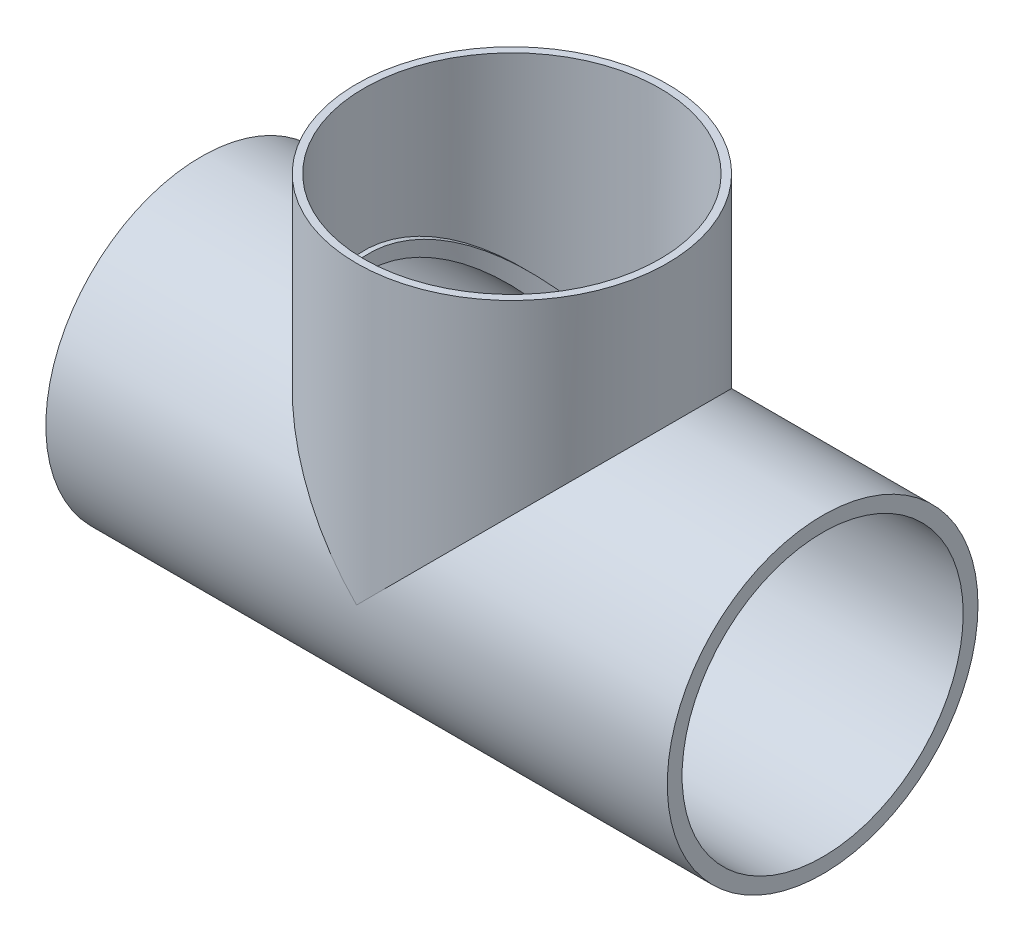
ISO-10303-21;
HEADER;
FILE_DESCRIPTION(('STEP AP214'),'2;1');
FILE_NAME('part.step','',(''),(''),'','','');
FILE_SCHEMA(('AUTOMOTIVE_DESIGN { 1 0 10303 214 1 1 1 1 }'));
ENDSEC;
DATA;
#1=APPLICATION_CONTEXT('core data for automotive mechanical design processes');
#2=APPLICATION_PROTOCOL_DEFINITION('international standard','automotive_design',2000,#1);
#3=PRODUCT_CONTEXT('',#1,'mechanical');
#4=PRODUCT('Part','Part','',(#3));
#5=PRODUCT_RELATED_PRODUCT_CATEGORY('part','',(#4));
#6=PRODUCT_DEFINITION_FORMATION('','',#4);
#7=PRODUCT_DEFINITION_CONTEXT('part definition',#1,'design');
#8=PRODUCT_DEFINITION('design','',#6,#7);
#9=PRODUCT_DEFINITION_SHAPE('','',#8);
#10=(LENGTH_UNIT() NAMED_UNIT(*) SI_UNIT(.MILLI.,.METRE.));
#11=(NAMED_UNIT(*) PLANE_ANGLE_UNIT() SI_UNIT($,.RADIAN.));
#12=(NAMED_UNIT(*) SI_UNIT($,.STERADIAN.) SOLID_ANGLE_UNIT());
#13=UNCERTAINTY_MEASURE_WITH_UNIT(LENGTH_MEASURE(1.E-05),#10,'distance_accuracy_value','');
#14=(GEOMETRIC_REPRESENTATION_CONTEXT(3) GLOBAL_UNCERTAINTY_ASSIGNED_CONTEXT((#13)) GLOBAL_UNIT_ASSIGNED_CONTEXT((#10,
#11,#12)) REPRESENTATION_CONTEXT('',''));
#15=CARTESIAN_POINT('',(0.,0.,0.));
#16=DIRECTION('',(0.,0.,1.));
#17=DIRECTION('',(1.,0.,0.));
#18=AXIS2_PLACEMENT_3D('',#15,#16,#17);
#19=CARTESIAN_POINT('',(126.,0.,0.));
#20=DIRECTION('',(-1.,0.,0.));
#21=DIRECTION('',(0.,0.,1.));
#22=AXIS2_PLACEMENT_3D('',#19,#20,#21);
#23=CYLINDRICAL_SURFACE('',#22,28.5);
#24=CARTESIAN_POINT('',(126.,0.,0.));
#25=DIRECTION('',(1.,0.,0.));
#26=DIRECTION('',(0.,0.,-1.));
#27=AXIS2_PLACEMENT_3D('',#24,#25,#26);
#28=CIRCLE('',#27,28.5);
#29=CARTESIAN_POINT('',(126.,0.,-28.5));
#30=VERTEX_POINT('',#29);
#31=EDGE_CURVE('E175',#30,#30,#28,.T.);
#32=ORIENTED_EDGE('',*,*,#31,.T.);
#33=EDGE_LOOP('',(#32));
#34=FACE_BOUND('',#33,.T.);
#35=CARTESIAN_POINT('',(0.,0.,0.));
#36=DIRECTION('',(1.,0.,0.));
#37=DIRECTION('',(0.,0.,-1.));
#38=AXIS2_PLACEMENT_3D('',#35,#36,#37);
#39=CIRCLE('',#38,28.5);
#40=CARTESIAN_POINT('',(0.,0.,-28.5));
#41=VERTEX_POINT('',#40);
#42=EDGE_CURVE('E170',#41,#41,#39,.T.);
#43=ORIENTED_EDGE('',*,*,#42,.F.);
#44=EDGE_LOOP('',(#43));
#45=FACE_BOUND('',#44,.T.);
#46=CARTESIAN_POINT('',(81.781639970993,18.,22.0963797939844));
#47=CARTESIAN_POINT('',(82.0534936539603,18.2836542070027,21.8653014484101));
#48=CARTESIAN_POINT('',(82.3229213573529,18.5642402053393,21.6276551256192));
#49=CARTESIAN_POINT('',(82.8563806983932,19.1188821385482,21.1389473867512));
#50=CARTESIAN_POINT('',(83.1204115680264,19.3929371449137,20.8878840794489));
#51=CARTESIAN_POINT('',(83.9042977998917,20.2054455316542,20.113440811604));
#52=CARTESIAN_POINT('',(84.4150893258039,20.7333486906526,19.5695316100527));
#53=CARTESIAN_POINT('',(85.4114756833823,21.7609780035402,18.420365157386));
#54=CARTESIAN_POINT('',(85.8967765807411,22.2603795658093,17.8145618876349));
#55=CARTESIAN_POINT('',(86.8298727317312,23.2190636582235,16.5455930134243));
#56=CARTESIAN_POINT('',(87.2776950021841,23.6783750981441,15.8824694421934));
#57=CARTESIAN_POINT('',(88.024032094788,24.4429387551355,14.6687886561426));
#58=CARTESIAN_POINT('',(88.3322185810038,24.7583368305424,14.1305417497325));
#59=CARTESIAN_POINT('',(88.9194633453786,25.3588747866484,13.0220842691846));
#60=CARTESIAN_POINT('',(89.1985222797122,25.6440153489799,12.4518744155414));
#61=CARTESIAN_POINT('',(89.7228298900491,26.1794302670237,11.2827098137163));
#62=CARTESIAN_POINT('',(89.9681778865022,26.4298070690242,10.6838468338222));
#63=CARTESIAN_POINT('',(90.4220872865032,26.8928048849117,9.45812562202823));
#64=CARTESIAN_POINT('',(90.6306489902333,27.1054262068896,8.83126761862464));
#65=CARTESIAN_POINT('',(91.0091355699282,27.4911453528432,7.54598564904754));
#66=CARTESIAN_POINT('',(91.178614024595,27.6637865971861,6.88729188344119));
#67=CARTESIAN_POINT('',(91.4722954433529,27.9628755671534,5.5495266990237));
#68=CARTESIAN_POINT('',(91.5964978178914,28.0893226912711,4.87045501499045));
#69=CARTESIAN_POINT('',(91.7965963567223,28.2930083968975,3.49810167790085));
#70=CARTESIAN_POINT('',(91.8725060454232,28.3702607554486,2.80482405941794));
#71=CARTESIAN_POINT('',(91.9740849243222,28.4736315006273,1.41085065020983));
#72=CARTESIAN_POINT('',(91.9997624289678,28.4997583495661,0.71015610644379));
#73=CARTESIAN_POINT('',(92.0001991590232,28.5002025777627,-0.586360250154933));
#74=CARTESIAN_POINT('',(91.9819969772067,28.481681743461,-1.18219933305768));
#75=CARTESIAN_POINT('',(91.9091687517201,28.4075709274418,-2.36926945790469));
#76=CARTESIAN_POINT('',(91.8545470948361,28.3519854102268,-2.96050104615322));
#77=CARTESIAN_POINT('',(91.709927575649,28.2047891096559,-4.13395143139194));
#78=CARTESIAN_POINT('',(91.6199350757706,28.1131837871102,-4.71617158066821));
#79=CARTESIAN_POINT('',(91.4061906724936,27.8955567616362,-5.8678249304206));
#80=CARTESIAN_POINT('',(91.2824374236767,27.7695336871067,-6.43725762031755));
#81=CARTESIAN_POINT('',(91.0056330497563,27.4875642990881,-7.55035184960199));
#82=CARTESIAN_POINT('',(90.8531207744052,27.3321682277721,-8.09428787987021));
#83=CARTESIAN_POINT('',(90.5197185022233,26.9923320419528,-9.16400492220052));
#84=CARTESIAN_POINT('',(90.3388296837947,26.8078931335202,-9.68978668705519));
#85=CARTESIAN_POINT('',(89.950942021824,26.4122093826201,-10.7215015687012));
#86=CARTESIAN_POINT('',(89.7439315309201,26.2009525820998,-11.2274256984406));
#87=CARTESIAN_POINT('',(89.3062304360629,25.7540248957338,-12.2178364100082));
#88=CARTESIAN_POINT('',(89.0755348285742,25.5183488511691,-12.7023184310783));
#89=CARTESIAN_POINT('',(88.4785590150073,24.9080845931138,-13.8728290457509));
#90=CARTESIAN_POINT('',(88.0997663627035,24.5205243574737,-14.5457785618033));
#91=CARTESIAN_POINT('',(87.3027715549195,23.7040622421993,-15.8415419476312));
#92=CARTESIAN_POINT('',(86.8845507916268,23.2751408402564,-16.4643318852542));
#93=CARTESIAN_POINT('',(86.0146346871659,22.3815519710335,-17.6599468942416));
#94=CARTESIAN_POINT('',(85.5629046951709,21.9168474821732,-18.2327188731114));
#95=CARTESIAN_POINT('',(84.632069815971,20.9573378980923,-19.3279550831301));
#96=CARTESIAN_POINT('',(84.1529759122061,20.462544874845,-19.8504392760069));
#97=CARTESIAN_POINT('',(83.3566317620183,19.637953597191,-20.6590839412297));
#98=CARTESIAN_POINT('',(83.0462566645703,19.3160649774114,-20.9602385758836));
#99=CARTESIAN_POINT('',(82.4188987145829,18.6641731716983,-21.5427203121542));
#100=CARTESIAN_POINT('',(82.1019441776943,18.334203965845,-21.824115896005));
#101=CARTESIAN_POINT('',(81.781639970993,18.,-22.0963797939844));
#102=B_SPLINE_CURVE_WITH_KNOTS('',3,(#46,#47,#48,#49,#50,#51,#52,#53,#54,#55,#56,#57,#58,#59,
#60,#61,#62,#63,#64,#65,#66,#67,#68,#69,#70,#71,#72,#73,#74,#75,#76,#77,#78,#79,#80,#81,#82,#83,
#84,#85,#86,#87,#88,#89,#90,#91,#92,#93,#94,#95,#96,#97,#98,#99,#100,#101),.UNSPECIFIED.,.F.,
.F.,(4,2,2,2,2,2,2,2,2,2,2,2,2,2,2,2,2,2,2,2,2,2,2,2,2,2,2,4),(0.,1.36729660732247,
2.7347864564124,5.47406022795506,8.24001927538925,11.0039669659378,13.089641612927,
15.1752692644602,17.2546139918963,19.3339417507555,21.4359582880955,23.5380021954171,
25.63945716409,27.7405642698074,29.5275457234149,31.3143119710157,33.1008074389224,
34.887374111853,36.6433015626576,38.3991561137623,40.15579636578,41.9128084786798,
44.5010099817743,47.0904391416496,49.6825843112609,52.2736962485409,53.8906025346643,
55.501595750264),.UNSPECIFIED.);
#103=CARTESIAN_POINT('',(81.781639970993,18.,22.0963797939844));
#104=VERTEX_POINT('',#103);
#105=CARTESIAN_POINT('',(81.781639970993,18.,-22.0963797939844));
#106=VERTEX_POINT('',#105);
#107=EDGE_CURVE('E106',#104,#106,#102,.T.);
#108=ORIENTED_EDGE('',*,*,#107,.T.);
#109=DIRECTION('',(-1.,0.,0.));
#110=VECTOR('',#109,1.);
#111=CARTESIAN_POINT('',(126.,18.,-22.0963797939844));
#112=LINE('',#111,#110);
#113=CARTESIAN_POINT('',(44.2183600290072,18.,-22.0963797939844));
#114=VERTEX_POINT('',#113);
#115=EDGE_CURVE('E141',#106,#114,#112,.T.);
#116=ORIENTED_EDGE('',*,*,#115,.T.);
#117=CARTESIAN_POINT('',(44.2183600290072,18.,-22.0963797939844));
#118=CARTESIAN_POINT('',(43.9465063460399,18.2836542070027,-21.8653014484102));
#119=CARTESIAN_POINT('',(43.6770786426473,18.5642402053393,-21.6276551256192));
#120=CARTESIAN_POINT('',(43.143619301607,19.1188821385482,-21.1389473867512));
#121=CARTESIAN_POINT('',(42.8795884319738,19.3929371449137,-20.8878840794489));
#122=CARTESIAN_POINT('',(42.0957022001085,20.2054455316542,-20.113440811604));
#123=CARTESIAN_POINT('',(41.5849106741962,20.7333486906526,-19.5695316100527));
#124=CARTESIAN_POINT('',(40.5885243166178,21.7609780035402,-18.420365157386));
#125=CARTESIAN_POINT('',(40.1032234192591,22.2603795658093,-17.8145618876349));
#126=CARTESIAN_POINT('',(39.170127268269,23.2190636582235,-16.5455930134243));
#127=CARTESIAN_POINT('',(38.7223049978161,23.6783750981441,-15.8824694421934));
#128=CARTESIAN_POINT('',(37.9759679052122,24.4429387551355,-14.6687886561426));
#129=CARTESIAN_POINT('',(37.6677814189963,24.7583368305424,-14.1305417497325));
#130=CARTESIAN_POINT('',(37.0805366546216,25.3588747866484,-13.0220842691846));
#131=CARTESIAN_POINT('',(36.8014777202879,25.6440153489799,-12.4518744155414));
#132=CARTESIAN_POINT('',(36.2771701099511,26.1794302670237,-11.2827098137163));
#133=CARTESIAN_POINT('',(36.031822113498,26.4298070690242,-10.6838468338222));
#134=CARTESIAN_POINT('',(35.577912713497,26.8928048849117,-9.45812562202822));
#135=CARTESIAN_POINT('',(35.3693510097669,27.1054262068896,-8.83126761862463));
#136=CARTESIAN_POINT('',(34.9908644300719,27.4911453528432,-7.54598564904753));
#137=CARTESIAN_POINT('',(34.8213859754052,27.6637865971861,-6.88729188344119));
#138=CARTESIAN_POINT('',(34.5277045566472,27.9628755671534,-5.54952669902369));
#139=CARTESIAN_POINT('',(34.4035021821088,28.0893226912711,-4.87045501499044));
#140=CARTESIAN_POINT('',(34.2034036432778,28.2930083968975,-3.49810167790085));
#141=CARTESIAN_POINT('',(34.127493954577,28.3702607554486,-2.80482405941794));
#142=CARTESIAN_POINT('',(34.025915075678,28.4736315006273,-1.41085065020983));
#143=CARTESIAN_POINT('',(34.0002375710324,28.4997583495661,-0.710156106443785));
#144=CARTESIAN_POINT('',(33.999800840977,28.5002025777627,0.586360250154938));
#145=CARTESIAN_POINT('',(34.0180030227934,28.481681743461,1.18219933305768));
#146=CARTESIAN_POINT('',(34.0908312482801,28.4075709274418,2.3692694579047));
#147=CARTESIAN_POINT('',(34.1454529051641,28.3519854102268,2.96050104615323));
#148=CARTESIAN_POINT('',(34.2900724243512,28.2047891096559,4.13395143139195));
#149=CARTESIAN_POINT('',(34.3800649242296,28.1131837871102,4.71617158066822));
#150=CARTESIAN_POINT('',(34.5938093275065,27.8955567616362,5.86782493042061));
#151=CARTESIAN_POINT('',(34.7175625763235,27.7695336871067,6.43725762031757));
#152=CARTESIAN_POINT('',(34.9943669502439,27.4875642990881,7.550351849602));
#153=CARTESIAN_POINT('',(35.146879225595,27.3321682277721,8.09428787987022));
#154=CARTESIAN_POINT('',(35.4802814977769,26.9923320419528,9.16400492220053));
#155=CARTESIAN_POINT('',(35.6611703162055,26.8078931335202,9.68978668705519));
#156=CARTESIAN_POINT('',(36.0490579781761,26.4122093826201,10.7215015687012));
#157=CARTESIAN_POINT('',(36.2560684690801,26.2009525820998,11.2274256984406));
#158=CARTESIAN_POINT('',(36.6937695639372,25.7540248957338,12.2178364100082));
#159=CARTESIAN_POINT('',(36.924465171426,25.5183488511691,12.7023184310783));
#160=CARTESIAN_POINT('',(37.5214409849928,24.9080845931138,13.8728290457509));
#161=CARTESIAN_POINT('',(37.9002336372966,24.5205243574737,14.5457785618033));
#162=CARTESIAN_POINT('',(38.6972284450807,23.7040622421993,15.8415419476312));
#163=CARTESIAN_POINT('',(39.1154492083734,23.2751408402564,16.4643318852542));
#164=CARTESIAN_POINT('',(39.9853653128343,22.3815519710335,17.6599468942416));
#165=CARTESIAN_POINT('',(40.4370953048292,21.9168474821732,18.2327188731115));
#166=CARTESIAN_POINT('',(41.3679301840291,20.9573378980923,19.3279550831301));
#167=CARTESIAN_POINT('',(41.8470240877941,20.462544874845,19.8504392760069));
#168=CARTESIAN_POINT('',(42.6433682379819,19.637953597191,20.6590839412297));
#169=CARTESIAN_POINT('',(42.9537433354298,19.3160649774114,20.9602385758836));
#170=CARTESIAN_POINT('',(43.5811012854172,18.6641731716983,21.5427203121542));
#171=CARTESIAN_POINT('',(43.8980558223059,18.334203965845,21.824115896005));
#172=CARTESIAN_POINT('',(44.2183600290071,18.,22.0963797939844));
#173=B_SPLINE_CURVE_WITH_KNOTS('',3,(#117,#118,#119,#120,#121,#122,#123,#124,#125,#126,#127,
#128,#129,#130,#131,#132,#133,#134,#135,#136,#137,#138,#139,#140,#141,#142,#143,#144,#145,#146,
#147,#148,#149,#150,#151,#152,#153,#154,#155,#156,#157,#158,#159,#160,#161,#162,#163,#164,#165,
#166,#167,#168,#169,#170,#171,#172),.UNSPECIFIED.,.F.,.F.,(4,2,2,2,2,2,2,2,2,2,2,2,2,2,2,2,2,2,
2,2,2,2,2,2,2,2,2,4),(0.,1.36729660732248,2.73478645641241,5.47406022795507,8.24001927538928,
11.0039669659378,13.089641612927,15.1752692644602,17.2546139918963,19.3339417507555,
21.4359582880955,23.5380021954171,25.63945716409,27.7405642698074,29.5275457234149,
31.3143119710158,33.1008074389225,34.887374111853,36.6433015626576,38.3991561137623,
40.15579636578,41.9128084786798,44.5010099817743,47.0904391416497,49.682584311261,
52.273696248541,53.8906025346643,55.501595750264),.UNSPECIFIED.);
#174=CARTESIAN_POINT('',(44.2183600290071,18.,22.0963797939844));
#175=VERTEX_POINT('',#174);
#176=EDGE_CURVE('E134',#114,#175,#173,.T.);
#177=ORIENTED_EDGE('',*,*,#176,.T.);
#178=DIRECTION('',(-1.,0.,0.));
#179=VECTOR('',#178,1.);
#180=CARTESIAN_POINT('',(126.,18.,22.0963797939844));
#181=LINE('',#180,#179);
#182=EDGE_CURVE('E108',#175,#104,#181,.F.);
#183=ORIENTED_EDGE('',*,*,#182,.T.);
#184=EDGE_LOOP('',(#108,#116,#177,#183));
#185=FACE_BOUND('',#184,.T.);
#186=ADVANCED_FACE('F49',(#34,#45,#185),#23,.F.);
#187=CARTESIAN_POINT('',(126.,0.,0.));
#188=DIRECTION('',(-1.,0.,0.));
#189=DIRECTION('',(0.,0.,1.));
#190=AXIS2_PLACEMENT_3D('',#187,#188,#189);
#191=CYLINDRICAL_SURFACE('',#190,31.5);
#192=CARTESIAN_POINT('',(63.0000000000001,9.60468635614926,30.));
#193=CARTESIAN_POINT('',(63.3038714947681,9.60467570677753,30.0000020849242));
#194=CARTESIAN_POINT('',(63.6077095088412,9.61918411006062,29.9953696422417));
#195=CARTESIAN_POINT('',(64.2124320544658,9.67622766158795,29.9770163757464));
#196=CARTESIAN_POINT('',(64.5133165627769,9.71876303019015,29.9632954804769));
#197=CARTESIAN_POINT('',(65.1108721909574,9.82950395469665,29.9271483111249));
#198=CARTESIAN_POINT('',(65.4075234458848,9.89780452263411,29.9046898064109));
#199=CARTESIAN_POINT('',(65.994140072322,10.0565927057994,29.8516657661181));
#200=CARTESIAN_POINT('',(66.2841019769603,10.1470915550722,29.8210961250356));
#201=CARTESIAN_POINT('',(67.0322234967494,10.4077462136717,29.7314242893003));
#202=CARTESIAN_POINT('',(67.4844909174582,10.5927186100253,29.6663206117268));
#203=CARTESIAN_POINT('',(68.370403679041,10.9970694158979,29.5188215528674));
#204=CARTESIAN_POINT('',(68.8040329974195,11.2164767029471,29.4364116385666));
#205=CARTESIAN_POINT('',(69.6561562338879,11.6801674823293,29.2555272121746));
#206=CARTESIAN_POINT('',(70.0745924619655,11.9245345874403,29.1569979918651));
#207=CARTESIAN_POINT('',(70.8969978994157,12.4301059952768,28.9450801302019));
#208=CARTESIAN_POINT('',(71.3009707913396,12.6913059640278,28.8316953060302));
#209=CARTESIAN_POINT('',(72.165562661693,13.2716898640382,28.5697454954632));
#210=CARTESIAN_POINT('',(72.6238759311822,13.5930817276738,28.4184885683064));
#211=CARTESIAN_POINT('',(73.526238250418,14.2462268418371,28.0967562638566));
#212=CARTESIAN_POINT('',(73.9702840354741,14.5779824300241,27.9262765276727));
#213=CARTESIAN_POINT('',(74.8461711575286,15.2480234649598,27.5661497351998));
#214=CARTESIAN_POINT('',(75.2780010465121,15.5863145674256,27.376485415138));
#215=CARTESIAN_POINT('',(76.1301588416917,16.2660729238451,26.9781409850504));
#216=CARTESIAN_POINT('',(76.5504876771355,16.6075399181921,26.7694624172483));
#217=CARTESIAN_POINT('',(77.3803316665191,17.2912899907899,26.3329794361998));
#218=CARTESIAN_POINT('',(77.7898478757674,17.6335729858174,26.105176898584));
#219=CARTESIAN_POINT('',(78.598443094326,18.3170630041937,25.6302246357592));
#220=CARTESIAN_POINT('',(78.9975218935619,18.6582700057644,25.3830745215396));
#221=CARTESIAN_POINT('',(79.7850659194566,19.3377569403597,24.8693078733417));
#222=CARTESIAN_POINT('',(80.1735367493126,19.6760383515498,24.6027019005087));
#223=CARTESIAN_POINT('',(80.939851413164,20.3483295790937,24.0496358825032));
#224=CARTESIAN_POINT('',(81.3176954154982,20.6823394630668,23.7631761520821));
#225=CARTESIAN_POINT('',(82.3210690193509,21.5747590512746,22.9640416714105));
#226=CARTESIAN_POINT('',(82.9363702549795,22.1279109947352,22.4324290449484));
#227=CARTESIAN_POINT('',(84.1322366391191,23.2111502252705,21.309650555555));
#228=CARTESIAN_POINT('',(84.7127980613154,23.7412350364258,20.7184783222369));
#229=CARTESIAN_POINT('',(85.8333709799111,24.7702190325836,19.476531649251));
#230=CARTESIAN_POINT('',(86.3734604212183,25.2691778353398,18.8258774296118));
#231=CARTESIAN_POINT('',(87.4084174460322,26.229442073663,17.4631312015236));
#232=CARTESIAN_POINT('',(87.9032811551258,26.6907442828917,16.7510339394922));
#233=CARTESIAN_POINT('',(88.7231566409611,27.457519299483,15.4516342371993));
#234=CARTESIAN_POINT('',(89.0597228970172,27.7731378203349,14.8775780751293));
#235=CARTESIAN_POINT('',(89.6994292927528,28.3742409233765,13.6963936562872));
#236=CARTESIAN_POINT('',(90.0025885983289,28.6597427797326,13.0892846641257));
#237=CARTESIAN_POINT('',(90.5718132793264,29.1966772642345,11.8433176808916));
#238=CARTESIAN_POINT('',(90.8378781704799,29.4481094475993,11.2044592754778));
#239=CARTESIAN_POINT('',(91.3288839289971,29.9126955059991,9.89755094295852));
#240=CARTESIAN_POINT('',(91.5538241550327,30.1258487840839,9.22950056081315));
#241=CARTESIAN_POINT('',(91.9605177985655,30.5115945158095,7.86144771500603));
#242=CARTESIAN_POINT('',(92.1418405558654,30.6837823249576,7.1612019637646));
#243=CARTESIAN_POINT('',(92.4547763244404,30.9811470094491,5.73982474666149));
#244=CARTESIAN_POINT('',(92.5863890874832,31.1063236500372,5.01869317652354));
#245=CARTESIAN_POINT('',(92.7968022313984,31.3065228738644,3.56248327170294));
#246=CARTESIAN_POINT('',(92.8756472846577,31.3815878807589,2.82741727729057));
#247=CARTESIAN_POINT('',(92.9787485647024,31.4797571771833,1.35005774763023));
#248=CARTESIAN_POINT('',(93.0030132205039,31.5028694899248,0.60776534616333));
#249=CARTESIAN_POINT('',(92.9968639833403,31.4970135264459,-0.769232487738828));
#250=CARTESIAN_POINT('',(92.9738277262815,31.4750723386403,-1.40402249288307));
#251=CARTESIAN_POINT('',(92.8878103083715,31.3931685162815,-2.66835909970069));
#252=CARTESIAN_POINT('',(92.8248337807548,31.3332102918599,-3.29790630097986));
#253=CARTESIAN_POINT('',(92.6600698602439,31.1764190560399,-4.5472348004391));
#254=CARTESIAN_POINT('',(92.5582809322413,31.0795845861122,-5.16701571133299));
#255=CARTESIAN_POINT('',(92.3176257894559,30.850798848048,-6.39272510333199));
#256=CARTESIAN_POINT('',(92.1787580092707,30.7188460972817,-6.99865299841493));
#257=CARTESIAN_POINT('',(91.8681701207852,30.4239855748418,-8.18535824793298));
#258=CARTESIAN_POINT('',(91.6969015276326,30.261503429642,-8.76636040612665));
#259=CARTESIAN_POINT('',(91.3227513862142,29.90693363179,-9.90873481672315));
#260=CARTESIAN_POINT('',(91.1198712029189,29.7148472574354,-10.4701079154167));
#261=CARTESIAN_POINT('',(90.6849623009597,29.3036197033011,-11.571229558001));
#262=CARTESIAN_POINT('',(90.4529310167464,29.0844761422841,-12.1109761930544));
#263=CARTESIAN_POINT('',(89.9621532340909,28.6216881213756,-13.167445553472));
#264=CARTESIAN_POINT('',(89.7034010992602,28.3780384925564,-13.6841633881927));
#265=CARTESIAN_POINT('',(89.2329199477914,27.9358451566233,-14.5606342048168));
#266=CARTESIAN_POINT('',(89.0267293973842,27.7422989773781,-14.9259178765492));
#267=CARTESIAN_POINT('',(88.6021110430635,27.3443342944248,-15.6430669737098));
#268=CARTESIAN_POINT('',(88.3836854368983,27.1399177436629,-15.994934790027));
#269=CARTESIAN_POINT('',(87.7110867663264,26.5115475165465,-17.0305591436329));
#270=CARTESIAN_POINT('',(87.2396774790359,26.0725538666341,-17.6941782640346));
#271=CARTESIAN_POINT('',(86.2560186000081,25.1606496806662,-18.9685938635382));
#272=CARTESIAN_POINT('',(85.7436673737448,24.6876550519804,-19.5792505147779));
#273=CARTESIAN_POINT('',(84.6840778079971,23.7150777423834,-20.7466153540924));
#274=CARTESIAN_POINT('',(84.1368410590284,23.2154962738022,-21.3033259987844));
#275=CARTESIAN_POINT('',(83.1978655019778,22.3646711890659,-22.1881400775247));
#276=CARTESIAN_POINT('',(82.8146518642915,22.0190969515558,-22.5308921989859));
#277=CARTESIAN_POINT('',(82.0352249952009,21.3204107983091,-23.1931394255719));
#278=CARTESIAN_POINT('',(81.6390121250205,20.9672990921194,-23.5126351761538));
#279=CARTESIAN_POINT('',(80.8340139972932,20.2550447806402,-24.1289261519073));
#280=CARTESIAN_POINT('',(80.4252214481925,19.8958987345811,-24.4257078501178));
#281=CARTESIAN_POINT('',(79.5956888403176,19.1735565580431,-24.9967330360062));
#282=CARTESIAN_POINT('',(79.1749491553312,18.8103605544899,-25.2709772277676));
#283=CARTESIAN_POINT('',(78.3221705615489,18.0823020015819,-25.7969329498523));
#284=CARTESIAN_POINT('',(77.8901469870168,17.7174422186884,-26.0486731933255));
#285=CARTESIAN_POINT('',(77.014012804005,16.9877512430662,-26.5303106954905));
#286=CARTESIAN_POINT('',(76.5699014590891,16.6229200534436,-26.7602066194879));
#287=CARTESIAN_POINT('',(75.6692872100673,15.8962284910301,-27.1981567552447));
#288=CARTESIAN_POINT('',(75.2127937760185,15.5343661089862,-27.4062270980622));
#289=CARTESIAN_POINT('',(74.2859506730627,14.8167622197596,-27.8007381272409));
#290=CARTESIAN_POINT('',(73.8156034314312,14.461019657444,-27.9871825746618));
#291=CARTESIAN_POINT('',(72.9688943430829,13.8407411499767,-28.2979698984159));
#292=CARTESIAN_POINT('',(72.5957562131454,13.5740221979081,-28.4267411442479));
#293=CARTESIAN_POINT('',(71.8387569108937,13.0498632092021,-28.6711460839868));
#294=CARTESIAN_POINT('',(71.4548957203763,12.7924231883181,-28.7867797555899));
#295=CARTESIAN_POINT('',(70.674900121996,12.2908444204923,-29.0044798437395));
#296=CARTESIAN_POINT('',(70.2787684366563,12.046702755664,-29.1065492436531));
#297=CARTESIAN_POINT('',(69.4721769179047,11.5771940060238,-29.2964601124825));
#298=CARTESIAN_POINT('',(69.0617206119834,11.3518223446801,-29.3843050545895));
#299=CARTESIAN_POINT('',(68.3460152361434,10.9892894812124,-29.521373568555));
#300=CARTESIAN_POINT('',(68.0448525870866,10.8455257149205,-29.5744024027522));
#301=CARTESIAN_POINT('',(67.4336796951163,10.5750852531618,-29.672179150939));
#302=CARTESIAN_POINT('',(67.1236726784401,10.4484024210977,-29.7169300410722));
#303=CARTESIAN_POINT('',(66.4952578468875,10.2167397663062,-29.7973699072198));
#304=CARTESIAN_POINT('',(66.1768717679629,10.1117090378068,-29.8330801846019));
#305=CARTESIAN_POINT('',(65.5316437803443,9.9279304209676,-29.8947428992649));
#306=CARTESIAN_POINT('',(65.204805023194,9.84917288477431,-29.9206989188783));
#307=CARTESIAN_POINT('',(64.6109922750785,9.735414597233,-29.9578791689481));
#308=CARTESIAN_POINT('',(64.3452163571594,9.69479618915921,-29.9710174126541));
#309=CARTESIAN_POINT('',(63.8109899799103,9.63521223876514,-29.990226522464));
#310=CARTESIAN_POINT('',(63.5425399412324,9.616243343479,-29.9962984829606));
#311=CARTESIAN_POINT('',(63.0051982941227,9.60093691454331,-30.0012013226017));
#312=CARTESIAN_POINT('',(62.7363074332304,9.60457591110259,-30.0000397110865));
#313=CARTESIAN_POINT('',(62.199884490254,9.63423090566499,-29.9905288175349));
#314=CARTESIAN_POINT('',(61.9323525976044,9.66024994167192,-29.9821785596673));
#315=CARTESIAN_POINT('',(61.3400932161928,9.74170873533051,-29.955823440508));
#316=CARTESIAN_POINT('',(61.0161774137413,9.802488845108,-29.936056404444));
#317=CARTESIAN_POINT('',(60.3756272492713,9.95188950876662,-29.8867196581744));
#318=CARTESIAN_POINT('',(60.0589955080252,10.0405199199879,-29.8571464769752));
#319=CARTESIAN_POINT('',(59.4329264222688,10.241370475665,-29.7888502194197));
#320=CARTESIAN_POINT('',(59.1235253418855,10.3536892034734,-29.7500888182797));
#321=CARTESIAN_POINT('',(58.5135381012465,10.5971749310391,-29.6642300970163));
#322=CARTESIAN_POINT('',(58.2129515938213,10.7283411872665,-29.6171331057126));
#323=CARTESIAN_POINT('',(57.5467992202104,11.0399488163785,-29.5026001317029));
#324=CARTESIAN_POINT('',(57.1835616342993,11.2245514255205,-29.4330151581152));
#325=CARTESIAN_POINT('',(56.4687163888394,11.6110838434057,-29.2826876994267));
#326=CARTESIAN_POINT('',(56.1171141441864,11.8130215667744,-29.2019401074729));
#327=CARTESIAN_POINT('',(55.4237082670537,12.2300193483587,-29.029771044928));
#328=CARTESIAN_POINT('',(55.0819214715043,12.4451001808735,-28.9383324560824));
#329=CARTESIAN_POINT('',(54.4075239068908,12.8846928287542,-28.7453011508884));
#330=CARTESIAN_POINT('',(54.0749117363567,13.1092031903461,-28.6437099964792));
#331=CARTESIAN_POINT('',(53.4160810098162,13.5663164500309,-28.430072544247));
#332=CARTESIAN_POINT('',(53.0899031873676,13.7989544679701,-28.3179760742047));
#333=CARTESIAN_POINT('',(52.4448214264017,14.2693104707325,-28.0839077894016));
#334=CARTESIAN_POINT('',(52.1259181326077,14.5070289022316,-27.9619351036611));
#335=CARTESIAN_POINT('',(51.1796289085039,15.2250259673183,-27.5815396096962));
#336=CARTESIAN_POINT('',(50.5620555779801,15.7105763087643,-27.3084409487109));
#337=CARTESIAN_POINT('',(49.5012002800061,16.5648954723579,-26.7962145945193));
#338=CARTESIAN_POINT('',(49.0528716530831,16.9325803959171,-26.5656077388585));
#339=CARTESIAN_POINT('',(48.1684524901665,17.6681737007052,-26.0821634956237));
#340=CARTESIAN_POINT('',(47.7323628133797,18.0360820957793,-25.8293245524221));
#341=CARTESIAN_POINT('',(46.8719400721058,18.7700287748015,-25.3010011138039));
#342=CARTESIAN_POINT('',(46.4476143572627,19.1360657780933,-25.0255028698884));
#343=CARTESIAN_POINT('',(45.6111016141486,19.8640721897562,-24.4516558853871));
#344=CARTESIAN_POINT('',(45.1989144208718,20.2260416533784,-24.1533074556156));
#345=CARTESIAN_POINT('',(44.3885704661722,20.9427724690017,-23.5345185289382));
#346=CARTESIAN_POINT('',(43.990367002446,21.2975557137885,-23.2141648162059));
#347=CARTESIAN_POINT('',(43.2070851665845,21.9995310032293,-22.550038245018));
#348=CARTESIAN_POINT('',(42.8220072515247,22.3467227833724,-22.2062645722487));
#349=CARTESIAN_POINT('',(41.6881550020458,23.3739571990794,-21.1395774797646));
#350=CARTESIAN_POINT('',(40.9599958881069,24.0403404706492,-20.3807167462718));
#351=CARTESIAN_POINT('',(39.8090226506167,25.100605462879,-19.0438060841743));
#352=CARTESIAN_POINT('',(39.3673961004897,25.5093146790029,-18.493460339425));
#353=CARTESIAN_POINT('',(38.515936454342,26.3000829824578,-17.3504556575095));
#354=CARTESIAN_POINT('',(38.1061009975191,26.6821440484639,-16.7577998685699));
#355=CARTESIAN_POINT('',(37.3228041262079,27.414395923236,-15.530965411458));
#356=CARTESIAN_POINT('',(36.9493148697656,27.7646111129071,-14.8968191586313));
#357=CARTESIAN_POINT('',(36.243198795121,28.4281874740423,-13.5877273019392));
#358=CARTESIAN_POINT('',(35.9105652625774,28.7415547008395,-12.9127884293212));
#359=CARTESIAN_POINT('',(35.3445497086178,29.2757023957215,-11.6435657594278));
#360=CARTESIAN_POINT('',(35.1039301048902,29.5031441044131,-11.0553066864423));
#361=CARTESIAN_POINT('',(34.6574486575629,29.9256579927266,-9.85443939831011));
#362=CARTESIAN_POINT('',(34.451583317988,30.1207334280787,-9.24183363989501));
#363=CARTESIAN_POINT('',(34.0777459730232,30.4752894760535,-7.99539375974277));
#364=CARTESIAN_POINT('',(33.9097566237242,30.6347863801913,-7.36156950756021));
#365=CARTESIAN_POINT('',(33.614368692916,30.9154201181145,-6.07614160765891));
#366=CARTESIAN_POINT('',(33.486970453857,31.0365566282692,-5.42453780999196));
#367=CARTESIAN_POINT('',(33.2745260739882,31.2386414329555,-4.10435090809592));
#368=CARTESIAN_POINT('',(33.1897265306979,31.3193557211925,-3.43569196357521));
#369=CARTESIAN_POINT('',(33.065293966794,31.4378157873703,-2.09037573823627));
#370=CARTESIAN_POINT('',(33.025661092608,31.4755614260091,-1.413718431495));
#371=CARTESIAN_POINT('',(32.9924002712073,31.5072375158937,-0.0583676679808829));
#372=CARTESIAN_POINT('',(32.9987640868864,31.5011758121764,0.620325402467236));
#373=CARTESIAN_POINT('',(33.0573450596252,31.4453892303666,1.97388918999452));
#374=CARTESIAN_POINT('',(33.1095594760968,31.3956669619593,2.64876013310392));
#375=CARTESIAN_POINT('',(33.2518517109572,31.2602287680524,3.92714663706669));
#376=CARTESIAN_POINT('',(33.33799643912,31.1782524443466,4.53150618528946));
#377=CARTESIAN_POINT('',(33.5457348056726,30.9806828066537,5.72845329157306));
#378=CARTESIAN_POINT('',(33.6673257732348,30.8650920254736,6.32104173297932));
#379=CARTESIAN_POINT('',(33.9441155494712,30.6021657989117,7.49113462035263));
#380=CARTESIAN_POINT('',(34.099317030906,30.4548278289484,8.06863786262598));
#381=CARTESIAN_POINT('',(34.4411699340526,30.1306129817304,9.20574669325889));
#382=CARTESIAN_POINT('',(34.6278233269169,29.9537342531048,9.76535115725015));
#383=CARTESIAN_POINT('',(35.0435437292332,29.5602546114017,10.9007225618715));
#384=CARTESIAN_POINT('',(35.2745969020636,29.3418025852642,11.4751188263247));
#385=CARTESIAN_POINT('',(35.7669325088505,28.8770387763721,12.5990688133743));
#386=CARTESIAN_POINT('',(36.0282153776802,28.6307265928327,13.1486221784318));
#387=CARTESIAN_POINT('',(36.5782672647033,28.1131514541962,14.2216592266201));
#388=CARTESIAN_POINT('',(36.8670401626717,27.8418849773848,14.7451392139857));
#389=CARTESIAN_POINT('',(37.4695410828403,27.2771574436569,15.7653698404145));
#390=CARTESIAN_POINT('',(37.7832813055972,26.9836855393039,16.2621072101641));
#391=CARTESIAN_POINT('',(38.6159541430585,26.2068346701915,17.4998721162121));
#392=CARTESIAN_POINT('',(39.1511034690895,25.7094272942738,18.2212812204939));
#393=CARTESIAN_POINT('',(40.2682447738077,24.6766533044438,19.5972708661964));
#394=CARTESIAN_POINT('',(40.8502397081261,24.1412842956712,20.2518471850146));
#395=CARTESIAN_POINT('',(41.7544500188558,23.3154102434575,21.1852532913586));
#396=CARTESIAN_POINT('',(42.0615612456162,23.0358603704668,21.4887487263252));
#397=CARTESIAN_POINT('',(42.6853005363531,22.4704184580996,22.079342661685));
#398=CARTESIAN_POINT('',(43.0019255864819,22.1845284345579,22.3664462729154));
#399=CARTESIAN_POINT('',(43.9653234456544,21.3187528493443,23.2035605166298));
#400=CARTESIAN_POINT('',(44.6257554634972,20.7306366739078,23.7295147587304));
#401=CARTESIAN_POINT('',(45.9982575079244,19.5243051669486,24.7322235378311));
#402=CARTESIAN_POINT('',(46.7112416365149,18.9057060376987,25.2072597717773));
#403=CARTESIAN_POINT('',(47.806524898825,17.9737388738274,25.8716161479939));
#404=CARTESIAN_POINT('',(48.1760303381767,17.6623150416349,26.085089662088));
#405=CARTESIAN_POINT('',(48.9238340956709,17.0395269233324,26.496106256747));
#406=CARTESIAN_POINT('',(49.3021318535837,16.7281626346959,26.6936503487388));
#407=CARTESIAN_POINT('',(50.0670503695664,16.1078001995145,27.0725057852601));
#408=CARTESIAN_POINT('',(50.453650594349,15.7987983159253,27.2538524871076));
#409=CARTESIAN_POINT('',(51.2366989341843,15.1844085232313,27.6008728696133));
#410=CARTESIAN_POINT('',(51.6331477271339,14.8790208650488,27.7665454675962));
#411=CARTESIAN_POINT('',(52.4365888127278,14.274648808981,28.0820314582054));
#412=CARTESIAN_POINT('',(52.8435729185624,13.9756597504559,28.231856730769));
#413=CARTESIAN_POINT('',(53.6697726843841,13.3872658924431,28.5155687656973));
#414=CARTESIAN_POINT('',(54.0889858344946,13.0978591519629,28.6494587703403));
#415=CARTESIAN_POINT('',(54.8552263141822,12.5905747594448,28.8753902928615));
#416=CARTESIAN_POINT('',(55.1996475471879,12.3700955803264,28.9704115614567));
#417=CARTESIAN_POINT('',(55.8988998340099,11.9414919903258,29.1496943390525));
#418=CARTESIAN_POINT('',(56.2537310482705,11.7333677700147,29.2339556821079));
#419=CARTESIAN_POINT('',(56.9754042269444,11.3338164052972,29.3911670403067));
#420=CARTESIAN_POINT('',(57.3422512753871,11.1423964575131,29.4641121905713));
#421=CARTESIAN_POINT('',(58.0892405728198,10.7823239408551,29.5977759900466));
#422=CARTESIAN_POINT('',(58.4693810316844,10.613668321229,29.6584962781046));
#423=CARTESIAN_POINT('',(59.1856176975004,10.329973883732,29.758373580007));
#424=CARTESIAN_POINT('',(59.5197514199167,10.2106866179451,29.7993996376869));
#425=CARTESIAN_POINT('',(60.1977417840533,9.99995145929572,29.8707780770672));
#426=CARTESIAN_POINT('',(60.5415923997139,9.90848670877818,29.9011369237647));
#427=CARTESIAN_POINT('',(61.2356119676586,9.7595583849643,29.950078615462));
#428=CARTESIAN_POINT('',(61.5857370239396,9.70191469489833,29.968723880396));
#429=CARTESIAN_POINT('',(62.2905910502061,9.62449165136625,29.9936811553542));
#430=CARTESIAN_POINT('',(62.645318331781,9.60469878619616,29.9999975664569));
#431=CARTESIAN_POINT('',(63.0000000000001,9.60468635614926,30.));
#432=B_SPLINE_CURVE_WITH_KNOTS('',3,(#192,#193,#194,#195,#196,#197,#198,#199,#200,#201,#202,
#203,#204,#205,#206,#207,#208,#209,#210,#211,#212,#213,#214,#215,#216,#217,#218,#219,#220,#221,
#222,#223,#224,#225,#226,#227,#228,#229,#230,#231,#232,#233,#234,#235,#236,#237,#238,#239,#240,
#241,#242,#243,#244,#245,#246,#247,#248,#249,#250,#251,#252,#253,#254,#255,#256,#257,#258,#259,
#260,#261,#262,#263,#264,#265,#266,#267,#268,#269,#270,#271,#272,#273,#274,#275,#276,#277,#278,
#279,#280,#281,#282,#283,#284,#285,#286,#287,#288,#289,#290,#291,#292,#293,#294,#295,#296,#297,
#298,#299,#300,#301,#302,#303,#304,#305,#306,#307,#308,#309,#310,#311,#312,#313,#314,#315,#316,
#317,#318,#319,#320,#321,#322,#323,#324,#325,#326,#327,#328,#329,#330,#331,#332,#333,#334,#335,
#336,#337,#338,#339,#340,#341,#342,#343,#344,#345,#346,#347,#348,#349,#350,#351,#352,#353,#354,
#355,#356,#357,#358,#359,#360,#361,#362,#363,#364,#365,#366,#367,#368,#369,#370,#371,#372,#373,
#374,#375,#376,#377,#378,#379,#380,#381,#382,#383,#384,#385,#386,#387,#388,#389,#390,#391,#392,
#393,#394,#395,#396,#397,#398,#399,#400,#401,#402,#403,#404,#405,#406,#407,#408,#409,#410,#411,
#412,#413,#414,#415,#416,#417,#418,#419,#420,#421,#422,#423,#424,#425,#426,#427,#428,#429,#430,
#431),.UNSPECIFIED.,.T.,.F.,(4,2,2,2,2,2,2,2,2,2,2,2,2,2,2,2,2,2,2,2,2,2,2,2,2,2,2,2,2,2,2,2,2,
2,2,2,2,2,2,2,2,2,2,2,2,2,2,2,2,2,2,2,2,2,2,2,2,2,2,2,2,2,2,2,2,2,2,2,2,2,2,2,2,2,2,2,2,2,2,2,2,
2,2,2,2,2,2,2,2,2,2,2,2,2,2,2,2,2,2,2,2,2,2,2,2,2,2,2,2,2,2,2,2,2,2,2,2,2,2,4),(0.,
0.911190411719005,1.82238798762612,2.7369790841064,3.65203399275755,5.12820655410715,
6.60562373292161,8.08816338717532,9.57032284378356,11.3091626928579,13.0483976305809,
14.7892118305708,16.529884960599,18.2703875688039,20.0109251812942,21.7505249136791,
23.4900970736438,26.4378047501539,29.3858280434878,32.3280194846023,35.2704627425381,
37.4780731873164,39.6844104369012,41.8907764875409,44.0971769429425,46.3245421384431,
48.551918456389,50.7774067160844,53.0025512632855,54.9069447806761,56.8111174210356,
58.7153653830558,60.6196937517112,62.4992153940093,64.3786559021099,66.2582619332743,
68.1382652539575,69.5236605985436,70.9088078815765,73.6796919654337,76.4576819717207,
79.235545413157,81.0934099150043,82.9512228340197,84.8101336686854,86.6689864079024,
88.5254325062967,90.3819919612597,92.2371694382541,94.0920237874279,95.5208840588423,
96.9497467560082,98.3782946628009,99.8064932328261,100.819686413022,101.832514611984,
102.842933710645,103.852981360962,104.659638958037,105.466171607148,106.271867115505,
107.077672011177,108.066512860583,109.055704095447,110.049096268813,111.042449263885,
112.281631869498,113.521383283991,114.7631476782,116.004721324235,117.252560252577,
118.500509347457,120.994099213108,122.86563264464,124.737297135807,126.610105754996,
128.482888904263,130.348668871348,132.214513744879,135.942679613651,138.387236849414,
140.831612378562,143.274100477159,145.716186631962,147.739364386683,149.762338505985,
151.78438438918,153.806447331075,155.840084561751,157.873728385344,159.90700803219,
161.940166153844,163.785943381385,165.631581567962,167.477366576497,169.323267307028,
171.290989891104,173.258740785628,175.226769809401,177.19576650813,180.271452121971,
183.347331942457,184.890104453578,186.432393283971,189.516276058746,192.683681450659,
194.268294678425,195.852807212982,197.433771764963,199.014845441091,200.594725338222,
202.174283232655,203.433441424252,204.69261903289,205.952336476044,207.211884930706,
208.282214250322,209.351893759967,210.415823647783,211.479373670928),.UNSPECIFIED.);
#433=CARTESIAN_POINT('',(63.0000000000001,9.60468635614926,30.));
#434=VERTEX_POINT('',#433);
#435=EDGE_CURVE('E190',#434,#434,#432,.T.);
#436=ORIENTED_EDGE('',*,*,#435,.T.);
#437=EDGE_LOOP('',(#436));
#438=FACE_BOUND('',#437,.T.);
#439=DIRECTION('',(-1.,0.,0.));
#440=VECTOR('',#439,1.);
#441=CARTESIAN_POINT('',(126.,18.,-25.8505319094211));
#442=LINE('',#441,#440);
#443=CARTESIAN_POINT('',(76.1434394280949,18.,-25.8505319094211));
#444=VERTEX_POINT('',#443);
#445=CARTESIAN_POINT('',(49.8565605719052,18.,-25.8505319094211));
#446=VERTEX_POINT('',#445);
#447=EDGE_CURVE('E12',#444,#446,#442,.T.);
#448=ORIENTED_EDGE('',*,*,#447,.F.);
#449=CARTESIAN_POINT('',(76.143439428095,18.,25.8505319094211));
#450=CARTESIAN_POINT('',(76.3726072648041,18.1673459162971,25.734009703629));
#451=CARTESIAN_POINT('',(76.5998553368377,18.33531289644,25.6146369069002));
#452=CARTESIAN_POINT('',(77.0506143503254,18.6720981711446,25.3701797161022));
#453=CARTESIAN_POINT('',(77.2741253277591,18.8409164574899,25.2450953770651));
#454=CARTESIAN_POINT('',(77.9392137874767,19.3480676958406,24.8612553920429));
#455=CARTESIAN_POINT('',(78.3753457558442,19.6870962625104,24.5939133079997));
#456=CARTESIAN_POINT('',(79.2344134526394,20.3650806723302,24.0355337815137));
#457=CARTESIAN_POINT('',(79.6573138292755,20.7040342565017,23.7444393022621));
#458=CARTESIAN_POINT('',(80.4887511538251,21.3786671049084,23.1388865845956));
#459=CARTESIAN_POINT('',(80.8972883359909,21.7143464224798,22.8244287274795));
#460=CARTESIAN_POINT('',(81.7042646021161,22.3841078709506,22.1680857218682));
#461=CARTESIAN_POINT('',(82.1025340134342,22.7181274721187,21.8259272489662));
#462=CARTESIAN_POINT('',(82.8832854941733,23.3784463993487,21.1171266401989));
#463=CARTESIAN_POINT('',(83.2657669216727,23.7047454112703,20.7504835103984));
#464=CARTESIAN_POINT('',(84.3873571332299,24.668238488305,19.6140961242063));
#465=CARTESIAN_POINT('',(85.1018521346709,25.2910664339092,18.806891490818));
#466=CARTESIAN_POINT('',(86.1951950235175,26.2531558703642,17.4194910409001));
#467=CARTESIAN_POINT('',(86.5981331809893,26.6099777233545,16.8701178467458));
#468=CARTESIAN_POINT('',(87.3709801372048,27.2976825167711,15.7330134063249));
#469=CARTESIAN_POINT('',(87.7408904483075,27.628566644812,15.1452839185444));
#470=CARTESIAN_POINT('',(88.442259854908,28.2583600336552,13.9348026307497));
#471=CARTESIAN_POINT('',(88.7738699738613,28.5573944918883,13.3122038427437));
#472=CARTESIAN_POINT('',(89.3960259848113,29.1201405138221,12.0314729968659));
#473=CARTESIAN_POINT('',(89.6865782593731,29.3838575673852,11.3733464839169));
#474=CARTESIAN_POINT('',(90.179937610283,29.832704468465,10.1304075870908));
#475=CARTESIAN_POINT('',(90.3893584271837,30.0236716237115,9.55032342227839));
#476=CARTESIAN_POINT('',(90.7730015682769,30.3740597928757,8.36933170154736));
#477=CARTESIAN_POINT('',(90.9472272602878,30.533483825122,7.76842614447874));
#478=CARTESIAN_POINT('',(91.2579052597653,30.8181006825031,6.54880397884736));
#479=CARTESIAN_POINT('',(91.3943497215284,30.9432863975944,5.93008370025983));
#480=CARTESIAN_POINT('',(91.6271390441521,31.1570371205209,4.67886624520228));
#481=CARTESIAN_POINT('',(91.7234835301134,31.2456017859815,4.0463689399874));
#482=CARTESIAN_POINT('',(91.8746236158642,31.3845981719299,2.76964598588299));
#483=CARTESIAN_POINT('',(91.9292511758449,31.4348756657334,2.12538349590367));
#484=CARTESIAN_POINT('',(91.9952632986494,31.4956366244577,0.832761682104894));
#485=CARTESIAN_POINT('',(92.0066478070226,31.5061200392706,0.184402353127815));
#486=CARTESIAN_POINT('',(91.9859501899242,31.4870654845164,-1.11099696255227));
#487=CARTESIAN_POINT('',(91.953869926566,31.4575292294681,-1.75803700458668));
#488=CARTESIAN_POINT('',(91.8468732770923,31.3590761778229,-3.04551221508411));
#489=CARTESIAN_POINT('',(91.7719581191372,31.2901605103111,-3.68594757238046));
#490=CARTESIAN_POINT('',(91.587269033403,31.120422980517,-4.91178313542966));
#491=CARTESIAN_POINT('',(91.4802330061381,31.0221087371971,-5.49794921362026));
#492=CARTESIAN_POINT('',(91.2318835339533,30.794265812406,-6.65671398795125));
#493=CARTESIAN_POINT('',(91.0905727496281,30.6647395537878,-7.22931373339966));
#494=CARTESIAN_POINT('',(90.7757170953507,30.3765771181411,-8.35778538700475));
#495=CARTESIAN_POINT('',(90.6021849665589,30.2179524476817,-8.9136638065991));
#496=CARTESIAN_POINT('',(90.2250354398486,29.8738448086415,-10.0065873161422));
#497=CARTESIAN_POINT('',(90.0214136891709,29.6883579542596,-10.5436296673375));
#498=CARTESIAN_POINT('',(89.5123695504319,29.2256894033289,-11.776125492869));
#499=CARTESIAN_POINT('',(89.19586916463,28.9387695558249,-12.4633817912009));
#500=CARTESIAN_POINT('',(88.5182640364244,28.326853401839,-13.7977763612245));
#501=CARTESIAN_POINT('',(88.1571467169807,28.0018463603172,-14.4449032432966));
#502=CARTESIAN_POINT('',(87.3935497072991,27.3178744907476,-15.7002206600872));
#503=CARTESIAN_POINT('',(86.9908860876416,26.9587592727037,-16.3082168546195));
#504=CARTESIAN_POINT('',(86.1501016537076,26.213345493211,-17.4812382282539));
#505=CARTESIAN_POINT('',(85.7119808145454,25.8270469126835,-18.0462633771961));
#506=CARTESIAN_POINT('',(84.6069974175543,24.8598581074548,-19.369274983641));
#507=CARTESIAN_POINT('',(83.9232917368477,24.2671914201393,-20.104761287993));
#508=CARTESIAN_POINT('',(82.8550232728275,23.354612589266,-21.1429647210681));
#509=CARTESIAN_POINT('',(82.4915915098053,23.0463035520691,-21.478371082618));
#510=CARTESIAN_POINT('',(81.7511280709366,22.4235282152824,-22.1277569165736));
#511=CARTESIAN_POINT('',(81.374098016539,22.1090626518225,-22.4417389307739));
#512=CARTESIAN_POINT('',(80.6115383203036,21.4795369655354,-23.0448965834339));
#513=CARTESIAN_POINT('',(80.2261642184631,21.1645289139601,-23.3343239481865));
#514=CARTESIAN_POINT('',(79.4428562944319,20.5320290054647,-23.8927557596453));
#515=CARTESIAN_POINT('',(79.0449223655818,20.2145371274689,-24.1617600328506));
#516=CARTESIAN_POINT('',(78.2372437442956,19.5796071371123,-24.6790639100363));
#517=CARTESIAN_POINT('',(77.8275218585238,19.262169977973,-24.9274002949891));
#518=CARTESIAN_POINT('',(76.9952202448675,18.6291279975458,-25.4039968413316));
#519=CARTESIAN_POINT('',(76.5726409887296,18.3135231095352,-25.6322577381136));
#520=CARTESIAN_POINT('',(76.143439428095,18.,-25.8505319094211));
#521=B_SPLINE_CURVE_WITH_KNOTS('',3,(#449,#450,#451,#452,#453,#454,#455,#456,#457,#458,#459,
#460,#461,#462,#463,#464,#465,#466,#467,#468,#469,#470,#471,#472,#473,#474,#475,#476,#477,#478,
#479,#480,#481,#482,#483,#484,#485,#486,#487,#488,#489,#490,#491,#492,#493,#494,#495,#496,#497,
#498,#499,#500,#501,#502,#503,#504,#505,#506,#507,#508,#509,#510,#511,#512,#513,#514,#515,#516,
#517,#518,#519,#520),.UNSPECIFIED.,.F.,.F.,(4,2,2,2,2,2,2,2,2,2,2,2,2,2,2,2,2,2,2,2,2,2,2,2,2,2,
2,2,2,2,2,2,2,2,2,4),(0.,0.920227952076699,1.8404470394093,3.68088939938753,5.52588919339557,
7.3708588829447,9.23699984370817,11.1032166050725,14.8299654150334,17.1354953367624,
19.440919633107,21.7369182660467,24.0325595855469,25.9675034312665,27.9022620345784,
29.8374221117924,31.7726002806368,33.7155330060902,35.6584681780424,37.6013201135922,
39.5441163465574,41.3538932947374,43.1635298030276,44.9724522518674,46.781636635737,
49.2057236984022,51.63049565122,54.0665046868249,56.5025154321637,59.9942749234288,
61.7421902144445,63.4898977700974,65.2167073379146,66.9435315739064,68.6672139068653,
70.3908330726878),.UNSPECIFIED.);
#522=CARTESIAN_POINT('',(76.143439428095,18.,25.8505319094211));
#523=VERTEX_POINT('',#522);
#524=EDGE_CURVE('E58',#523,#444,#521,.T.);
#525=ORIENTED_EDGE('',*,*,#524,.F.);
#526=DIRECTION('',(-1.,0.,0.));
#527=VECTOR('',#526,1.);
#528=CARTESIAN_POINT('',(126.,18.,25.8505319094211));
#529=LINE('',#528,#527);
#530=CARTESIAN_POINT('',(49.8565605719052,18.,25.8505319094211));
#531=VERTEX_POINT('',#530);
#532=EDGE_CURVE('E93',#531,#523,#529,.F.);
#533=ORIENTED_EDGE('',*,*,#532,.F.);
#534=CARTESIAN_POINT('',(49.8565605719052,18.,-25.8505319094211));
#535=CARTESIAN_POINT('',(49.6273927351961,18.1673459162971,-25.734009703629));
#536=CARTESIAN_POINT('',(49.4001446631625,18.33531289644,-25.6146369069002));
#537=CARTESIAN_POINT('',(48.9493856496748,18.6720981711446,-25.3701797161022));
#538=CARTESIAN_POINT('',(48.7258746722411,18.8409164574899,-25.2450953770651));
#539=CARTESIAN_POINT('',(48.0607862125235,19.3480676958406,-24.8612553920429));
#540=CARTESIAN_POINT('',(47.6246542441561,19.6870962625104,-24.5939133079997));
#541=CARTESIAN_POINT('',(46.7655865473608,20.3650806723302,-24.0355337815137));
#542=CARTESIAN_POINT('',(46.3426861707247,20.7040342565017,-23.7444393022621));
#543=CARTESIAN_POINT('',(45.5112488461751,21.3786671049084,-23.1388865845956));
#544=CARTESIAN_POINT('',(45.1027116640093,21.7143464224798,-22.8244287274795));
#545=CARTESIAN_POINT('',(44.2957353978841,22.3841078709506,-22.1680857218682));
#546=CARTESIAN_POINT('',(43.897465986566,22.7181274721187,-21.8259272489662));
#547=CARTESIAN_POINT('',(43.1167145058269,23.3784463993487,-21.1171266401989));
#548=CARTESIAN_POINT('',(42.7342330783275,23.7047454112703,-20.7504835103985));
#549=CARTESIAN_POINT('',(41.6126428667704,24.6682384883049,-19.6140961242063));
#550=CARTESIAN_POINT('',(40.8981478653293,25.2910664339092,-18.806891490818));
#551=CARTESIAN_POINT('',(39.8048049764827,26.2531558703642,-17.4194910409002));
#552=CARTESIAN_POINT('',(39.4018668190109,26.6099777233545,-16.8701178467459));
#553=CARTESIAN_POINT('',(38.6290198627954,27.2976825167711,-15.7330134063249));
#554=CARTESIAN_POINT('',(38.2591095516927,27.628566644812,-15.1452839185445));
#555=CARTESIAN_POINT('',(37.5577401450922,28.2583600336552,-13.9348026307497));
#556=CARTESIAN_POINT('',(37.2261300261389,28.5573944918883,-13.3122038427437));
#557=CARTESIAN_POINT('',(36.6039740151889,29.1201405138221,-12.0314729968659));
#558=CARTESIAN_POINT('',(36.3134217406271,29.3838575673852,-11.3733464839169));
#559=CARTESIAN_POINT('',(35.8200623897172,29.832704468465,-10.1304075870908));
#560=CARTESIAN_POINT('',(35.6106415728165,30.0236716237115,-9.55032342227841));
#561=CARTESIAN_POINT('',(35.2269984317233,30.3740597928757,-8.36933170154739));
#562=CARTESIAN_POINT('',(35.0527727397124,30.533483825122,-7.76842614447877));
#563=CARTESIAN_POINT('',(34.7420947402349,30.8181006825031,-6.54880397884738));
#564=CARTESIAN_POINT('',(34.6056502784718,30.9432863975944,-5.93008370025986));
#565=CARTESIAN_POINT('',(34.3728609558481,31.1570371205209,-4.67886624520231));
#566=CARTESIAN_POINT('',(34.2765164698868,31.2456017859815,-4.04636893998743));
#567=CARTESIAN_POINT('',(34.125376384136,31.3845981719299,-2.76964598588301));
#568=CARTESIAN_POINT('',(34.0707488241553,31.4348756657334,-2.12538349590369));
#569=CARTESIAN_POINT('',(34.0047367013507,31.4956366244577,-0.832761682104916));
#570=CARTESIAN_POINT('',(33.9933521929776,31.5061200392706,-0.184402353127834));
#571=CARTESIAN_POINT('',(34.014049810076,31.4870654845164,1.11099696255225));
#572=CARTESIAN_POINT('',(34.0461300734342,31.4575292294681,1.75803700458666));
#573=CARTESIAN_POINT('',(34.1531267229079,31.3590761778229,3.04551221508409));
#574=CARTESIAN_POINT('',(34.2280418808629,31.2901605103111,3.68594757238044));
#575=CARTESIAN_POINT('',(34.4127309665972,31.120422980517,4.91178313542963));
#576=CARTESIAN_POINT('',(34.519766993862,31.0221087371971,5.49794921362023));
#577=CARTESIAN_POINT('',(34.7681164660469,30.794265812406,6.65671398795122));
#578=CARTESIAN_POINT('',(34.909427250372,30.6647395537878,7.22931373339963));
#579=CARTESIAN_POINT('',(35.2242829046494,30.3765771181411,8.35778538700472));
#580=CARTESIAN_POINT('',(35.3978150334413,30.2179524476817,8.91366380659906));
#581=CARTESIAN_POINT('',(35.7749645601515,29.8738448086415,10.0065873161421));
#582=CARTESIAN_POINT('',(35.9785863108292,29.6883579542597,10.5436296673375));
#583=CARTESIAN_POINT('',(36.4876304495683,29.2256894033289,11.7761254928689));
#584=CARTESIAN_POINT('',(36.8041308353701,28.9387695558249,12.4633817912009));
#585=CARTESIAN_POINT('',(37.4817359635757,28.326853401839,13.7977763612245));
#586=CARTESIAN_POINT('',(37.8428532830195,28.0018463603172,14.4449032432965));
#587=CARTESIAN_POINT('',(38.6064502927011,27.3178744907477,15.7002206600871));
#588=CARTESIAN_POINT('',(39.0091139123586,26.9587592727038,16.3082168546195));
#589=CARTESIAN_POINT('',(39.8498983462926,26.213345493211,17.4812382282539));
#590=CARTESIAN_POINT('',(40.2880191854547,25.8270469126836,18.0462633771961));
#591=CARTESIAN_POINT('',(41.3930025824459,24.8598581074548,19.3692749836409));
#592=CARTESIAN_POINT('',(42.0767082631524,24.2671914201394,20.104761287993));
#593=CARTESIAN_POINT('',(43.1449767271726,23.354612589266,21.1429647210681));
#594=CARTESIAN_POINT('',(43.5084084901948,23.0463035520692,21.478371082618));
#595=CARTESIAN_POINT('',(44.2488719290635,22.4235282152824,22.1277569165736));
#596=CARTESIAN_POINT('',(44.6259019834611,22.1090626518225,22.4417389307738));
#597=CARTESIAN_POINT('',(45.3884616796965,21.4795369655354,23.0448965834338));
#598=CARTESIAN_POINT('',(45.773835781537,21.1645289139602,23.3343239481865));
#599=CARTESIAN_POINT('',(46.5571437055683,20.5320290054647,23.8927557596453));
#600=CARTESIAN_POINT('',(46.9550776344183,20.2145371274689,24.1617600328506));
#601=CARTESIAN_POINT('',(47.7627562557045,19.5796071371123,24.6790639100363));
#602=CARTESIAN_POINT('',(48.1724781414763,19.262169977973,24.9274002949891));
#603=CARTESIAN_POINT('',(49.0047797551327,18.6291279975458,25.4039968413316));
#604=CARTESIAN_POINT('',(49.4273590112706,18.3135231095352,25.6322577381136));
#605=CARTESIAN_POINT('',(49.8565605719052,18.,25.8505319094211));
#606=B_SPLINE_CURVE_WITH_KNOTS('',3,(#534,#535,#536,#537,#538,#539,#540,#541,#542,#543,#544,
#545,#546,#547,#548,#549,#550,#551,#552,#553,#554,#555,#556,#557,#558,#559,#560,#561,#562,#563,
#564,#565,#566,#567,#568,#569,#570,#571,#572,#573,#574,#575,#576,#577,#578,#579,#580,#581,#582,
#583,#584,#585,#586,#587,#588,#589,#590,#591,#592,#593,#594,#595,#596,#597,#598,#599,#600,#601,
#602,#603,#604,#605),.UNSPECIFIED.,.F.,.F.,(4,2,2,2,2,2,2,2,2,2,2,2,2,2,2,2,2,2,2,2,2,2,2,2,2,2,
2,2,2,2,2,2,2,2,2,4),(0.,0.920227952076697,1.84044703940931,3.68088939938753,5.52588919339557,
7.3708588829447,9.23699984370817,11.1032166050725,14.8299654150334,17.1354953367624,
19.440919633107,21.7369182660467,24.0325595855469,25.9675034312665,27.9022620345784,
29.8374221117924,31.7726002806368,33.7155330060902,35.6584681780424,37.6013201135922,
39.5441163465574,41.3538932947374,43.1635298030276,44.9724522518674,46.781636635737,
49.2057236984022,51.63049565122,54.0665046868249,56.5025154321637,59.9942749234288,
61.7421902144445,63.4898977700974,65.2167073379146,66.9435315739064,68.6672139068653,
70.3908330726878),.UNSPECIFIED.);
#607=EDGE_CURVE('E98',#446,#531,#606,.T.);
#608=ORIENTED_EDGE('',*,*,#607,.F.);
#609=EDGE_LOOP('',(#448,#525,#533,#608));
#610=FACE_BOUND('',#609,.T.);
#611=ADVANCED_FACE('F51',(#438,#610),#191,.T.);
#612=CARTESIAN_POINT('',(0.,0.,0.));
#613=DIRECTION('',(1.,0.,0.));
#614=DIRECTION('',(0.,0.,-1.));
#615=AXIS2_PLACEMENT_3D('',#612,#613,#614);
#616=CIRCLE('',#615,31.5);
#617=CARTESIAN_POINT('',(0.,0.,-31.5));
#618=VERTEX_POINT('',#617);
#619=EDGE_CURVE('E173',#618,#618,#616,.T.);
#620=ORIENTED_EDGE('',*,*,#619,.T.);
#621=EDGE_LOOP('',(#620));
#622=FACE_BOUND('',#621,.T.);
#623=CARTESIAN_POINT('',(126.,0.,0.));
#624=DIRECTION('',(1.,0.,0.));
#625=DIRECTION('',(0.,0.,-1.));
#626=AXIS2_PLACEMENT_3D('',#623,#624,#625);
#627=CIRCLE('',#626,31.5);
#628=CARTESIAN_POINT('',(126.,0.,-31.5));
#629=VERTEX_POINT('',#628);
#630=EDGE_CURVE('E99',#629,#629,#627,.T.);
#631=ORIENTED_EDGE('',*,*,#630,.F.);
#632=EDGE_LOOP('',(#631));
#633=FACE_BOUND('',#632,.T.);
#634=CARTESIAN_POINT('',(63.0000000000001,0.,0.));
#635=DIRECTION('',(0.707106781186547,0.707106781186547,0.));
#636=DIRECTION('',(-0.707106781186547,0.707106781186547,0.));
#637=AXIS2_PLACEMENT_3D('',#634,#635,#636);
#638=ELLIPSE('',#637,44.5477272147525,31.5);
#639=CARTESIAN_POINT('',(63.0000000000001,0.,-31.5));
#640=VERTEX_POINT('',#639);
#641=CARTESIAN_POINT('',(63.0000000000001,0.,31.5));
#642=VERTEX_POINT('',#641);
#643=EDGE_CURVE('E189',#640,#642,#638,.T.);
#644=ORIENTED_EDGE('',*,*,#643,.F.);
#645=CARTESIAN_POINT('',(63.0000000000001,0.,0.));
#646=DIRECTION('',(-0.707106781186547,0.707106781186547,0.));
#647=DIRECTION('',(0.707106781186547,0.707106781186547,0.));
#648=AXIS2_PLACEMENT_3D('',#645,#646,#647);
#649=ELLIPSE('',#648,44.5477272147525,31.5);
#650=EDGE_CURVE('E195',#642,#640,#649,.T.);
#651=ORIENTED_EDGE('',*,*,#650,.F.);
#652=EDGE_LOOP('',(#644,#651));
#653=FACE_BOUND('',#652,.T.);
#654=ADVANCED_FACE('F158',(#622,#633,#653),#191,.T.);
#655=CARTESIAN_POINT('',(126.,0.,0.));
#656=DIRECTION('',(1.,0.,0.));
#657=DIRECTION('',(0.,0.,-1.));
#658=AXIS2_PLACEMENT_3D('',#655,#656,#657);
#659=PLANE('',#658);
#660=ORIENTED_EDGE('',*,*,#31,.F.);
#661=EDGE_LOOP('',(#660));
#662=FACE_BOUND('',#661,.T.);
#663=ORIENTED_EDGE('',*,*,#630,.T.);
#664=EDGE_LOOP('',(#663));
#665=FACE_BOUND('',#664,.T.);
#666=ADVANCED_FACE('F154',(#662,#665),#659,.T.);
#667=CARTESIAN_POINT('',(0.,0.,0.));
#668=DIRECTION('',(1.,0.,0.));
#669=DIRECTION('',(0.,0.,-1.));
#670=AXIS2_PLACEMENT_3D('',#667,#668,#669);
#671=PLANE('',#670);
#672=ORIENTED_EDGE('',*,*,#42,.T.);
#673=EDGE_LOOP('',(#672));
#674=FACE_BOUND('',#673,.T.);
#675=ORIENTED_EDGE('',*,*,#619,.F.);
#676=EDGE_LOOP('',(#675));
#677=FACE_BOUND('',#676,.T.);
#678=ADVANCED_FACE('F157',(#674,#677),#671,.F.);
#679=CARTESIAN_POINT('',(63.0000000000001,60.,0.));
#680=DIRECTION('',(0.,1.,0.));
#681=DIRECTION('',(0.,0.,1.));
#682=AXIS2_PLACEMENT_3D('',#679,#680,#681);
#683=PLANE('',#682);
#684=CARTESIAN_POINT('',(63.0000000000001,60.,0.));
#685=DIRECTION('',(0.,1.,0.));
#686=DIRECTION('',(0.,0.,1.));
#687=AXIS2_PLACEMENT_3D('',#684,#685,#686);
#688=CIRCLE('',#687,31.5);
#689=CARTESIAN_POINT('',(63.0000000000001,60.,31.5));
#690=VERTEX_POINT('',#689);
#691=EDGE_CURVE('E182',#690,#690,#688,.T.);
#692=ORIENTED_EDGE('',*,*,#691,.T.);
#693=EDGE_LOOP('',(#692));
#694=FACE_BOUND('',#693,.T.);
#695=CARTESIAN_POINT('',(63.0000000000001,60.,0.));
#696=DIRECTION('',(0.,1.,0.));
#697=DIRECTION('',(0.,0.,1.));
#698=AXIS2_PLACEMENT_3D('',#695,#696,#697);
#699=CIRCLE('',#698,30.);
#700=CARTESIAN_POINT('',(63.0000000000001,60.,30.));
#701=VERTEX_POINT('',#700);
#702=EDGE_CURVE('E186',#701,#701,#699,.T.);
#703=ORIENTED_EDGE('',*,*,#702,.F.);
#704=EDGE_LOOP('',(#703));
#705=FACE_BOUND('',#704,.T.);
#706=ADVANCED_FACE('F161',(#694,#705),#683,.T.);
#707=CARTESIAN_POINT('',(63.0000000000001,60.,0.));
#708=DIRECTION('',(0.,-1.,0.));
#709=DIRECTION('',(0.,0.,-1.));
#710=AXIS2_PLACEMENT_3D('',#707,#708,#709);
#711=CYLINDRICAL_SURFACE('',#710,31.5);
#712=ORIENTED_EDGE('',*,*,#691,.F.);
#713=EDGE_LOOP('',(#712));
#714=FACE_BOUND('',#713,.T.);
#715=ORIENTED_EDGE('',*,*,#643,.T.);
#716=ORIENTED_EDGE('',*,*,#650,.T.);
#717=EDGE_LOOP('',(#715,#716));
#718=FACE_BOUND('',#717,.T.);
#719=ADVANCED_FACE('F152',(#714,#718),#711,.T.);
#720=CARTESIAN_POINT('',(63.0000000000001,60.,0.));
#721=DIRECTION('',(0.,-1.,0.));
#722=DIRECTION('',(0.,0.,-1.));
#723=AXIS2_PLACEMENT_3D('',#720,#721,#722);
#724=CYLINDRICAL_SURFACE('',#723,30.);
#725=ORIENTED_EDGE('',*,*,#702,.T.);
#726=EDGE_LOOP('',(#725));
#727=FACE_BOUND('',#726,.T.);
#728=ORIENTED_EDGE('',*,*,#435,.F.);
#729=EDGE_LOOP('',(#728));
#730=FACE_BOUND('',#729,.T.);
#731=ADVANCED_FACE('F125',(#727,#730),#724,.F.);
#732=CARTESIAN_POINT('',(63.0000000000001,60.000012,0.));
#733=DIRECTION('',(0.,-1.,0.));
#734=DIRECTION('',(0.,0.,-1.));
#735=AXIS2_PLACEMENT_3D('',#732,#733,#734);
#736=CYLINDRICAL_SURFACE('',#735,29.);
#737=CARTESIAN_POINT('',(63.0000000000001,18.,0.));
#738=DIRECTION('',(0.,1.,0.));
#739=DIRECTION('',(0.,0.,1.));
#740=AXIS2_PLACEMENT_3D('',#737,#738,#739);
#741=CIRCLE('',#740,29.);
#742=EDGE_CURVE('E65',#523,#104,#741,.T.);
#743=ORIENTED_EDGE('',*,*,#742,.F.);
#744=ORIENTED_EDGE('',*,*,#524,.T.);
#745=EDGE_CURVE('E109',#106,#444,#741,.T.);
#746=ORIENTED_EDGE('',*,*,#745,.F.);
#747=ORIENTED_EDGE('',*,*,#107,.F.);
#748=EDGE_LOOP('',(#743,#744,#746,#747));
#749=FACE_BOUND('',#748,.T.);
#750=ADVANCED_FACE('F102',(#749),#736,.F.);
#751=EDGE_CURVE('E297',#446,#114,#741,.T.);
#752=ORIENTED_EDGE('',*,*,#751,.F.);
#753=ORIENTED_EDGE('',*,*,#607,.T.);
#754=EDGE_CURVE('E70',#175,#531,#741,.T.);
#755=ORIENTED_EDGE('',*,*,#754,.F.);
#756=ORIENTED_EDGE('',*,*,#176,.F.);
#757=EDGE_LOOP('',(#752,#753,#755,#756));
#758=FACE_BOUND('',#757,.T.);
#759=ADVANCED_FACE('F124',(#758),#736,.F.);
#760=CARTESIAN_POINT('',(63.0000000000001,18.,0.));
#761=DIRECTION('',(0.,1.,0.));
#762=DIRECTION('',(0.,0.,1.));
#763=AXIS2_PLACEMENT_3D('',#760,#761,#762);
#764=PLANE('',#763);
#765=ORIENTED_EDGE('',*,*,#745,.T.);
#766=ORIENTED_EDGE('',*,*,#447,.T.);
#767=ORIENTED_EDGE('',*,*,#751,.T.);
#768=ORIENTED_EDGE('',*,*,#115,.F.);
#769=EDGE_LOOP('',(#765,#766,#767,#768));
#770=FACE_BOUND('',#769,.T.);
#771=ADVANCED_FACE('F126',(#770),#764,.T.);
#772=ORIENTED_EDGE('',*,*,#754,.T.);
#773=ORIENTED_EDGE('',*,*,#532,.T.);
#774=ORIENTED_EDGE('',*,*,#742,.T.);
#775=ORIENTED_EDGE('',*,*,#182,.F.);
#776=EDGE_LOOP('',(#772,#773,#774,#775));
#777=FACE_BOUND('',#776,.T.);
#778=ADVANCED_FACE('F94',(#777),#764,.T.);
#779=CLOSED_SHELL('',(#186,#611,#654,#666,#678,#706,#719,#731,#750,#759,#771,#778));
#780=MANIFOLD_SOLID_BREP('B2',#779);
#781=ADVANCED_BREP_SHAPE_REPRESENTATION('',(#18,#780),#14);
#782=SHAPE_DEFINITION_REPRESENTATION(#9,#781);
ENDSEC;
END-ISO-10303-21;
